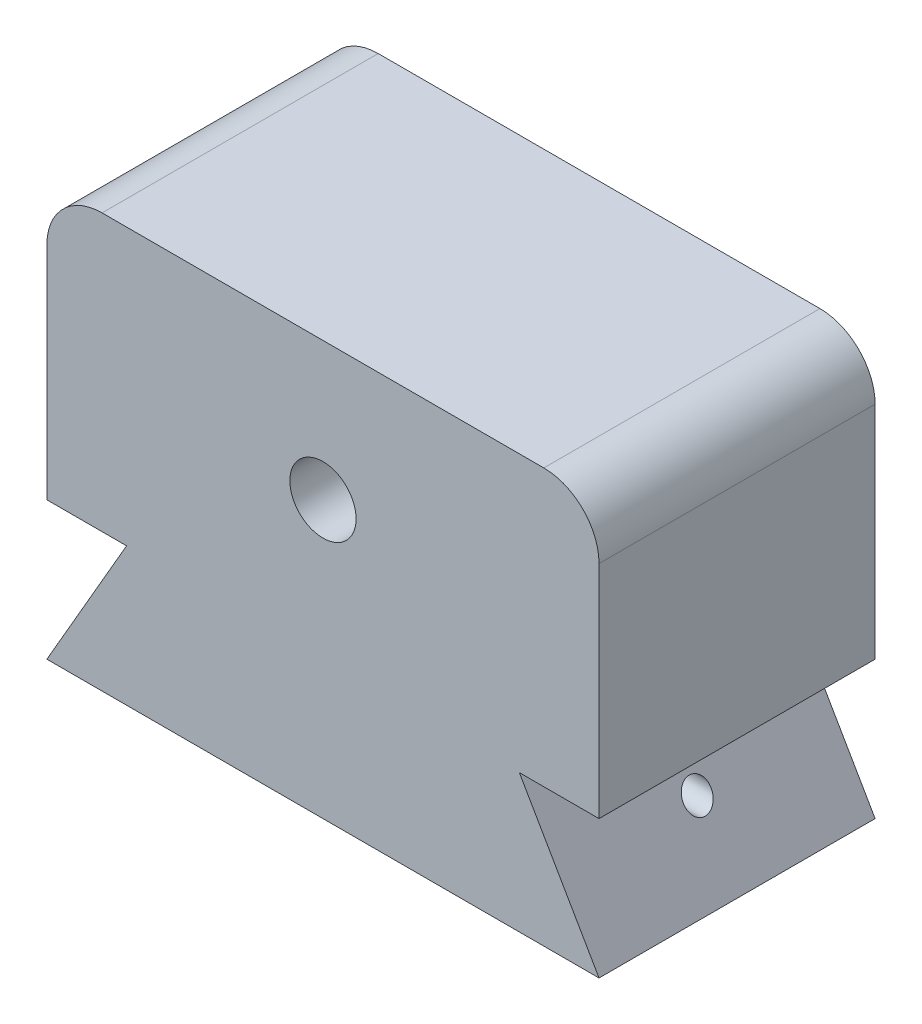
from build123d import *

# Parameters (mm, degrees)
SKETCH1_R                      = 6
BOSS_EXTRUDE1_DEPTH            = 50
SKETCH2_R                      = 6
CUT_EXTRUDE1_DEPTH             = 25
CUT_EXTRUDE2_REACH             = 105.078
SKETCH3_R                      = 2.5
CUT_EXTRUDE2_DIRECTION_2_REACH = 105.078


with BuildPart() as part:
    # Sketch1 → Boss-Extrude1 (new body)
    # profile 1 of 2: a face of its own
    with BuildSketch(Plane.XY):
        Polygon((-50, 0), (50, 0), (35.56624327, 25), (-35.56624327, 25), align=None)
    # profile 2 of 2: a face of its own
    with BuildSketch(Plane.XY):
        with BuildLine():
            Line((-50, 25), (50, 25))
            Line((50, 25), (50, 65))
            ThreePointArc((50, 65), (47.071067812, 72.071067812), (40, 75))
            Line((40, 75), (-40, 75))
            ThreePointArc((-40, 75), (-47.071067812, 72.071067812), (-50, 65))
            Line((-50, 65), (-50, 25))
        make_face()
        with Locations((0, 50)):
            Circle(SKETCH1_R, mode=Mode.SUBTRACT)
    extrude(amount=BOSS_EXTRUDE1_DEPTH)

    # Sketch2 → Cut-Extrude1 (cut)
    with BuildSketch(Plane.XZ):
        with Locations(Location((0, 25, 0), (0, 0, 270))):
            Circle(SKETCH2_R)
    extrude(amount=-CUT_EXTRUDE1_DEPTH, mode=Mode.SUBTRACT)

    # Cut-Extrude2: up to this plane
    cut_extrude2_end = Plane(origin=(-37.5, 21.650635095, 50), z_dir=(0.8660254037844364, -0.5000000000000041, 0))
    # Sketch3 → Cut-Extrude2 (cut, up to the surface)
    with BuildSketch(Plane(origin=(0, 0, 0), x_dir=(0, 0, -1), z_dir=(1, 0, 0)), mode=Mode.PRIVATE) as cut_extrude2_sk1:
        with Locations((-25, 12.5)):
            Circle(SKETCH3_R)
    cut_extrude2_tool1 = split(extrude(cut_extrude2_sk1.sketch, amount=-CUT_EXTRUDE2_REACH, mode=Mode.PRIVATE), bisect_by=cut_extrude2_end, keep=Keep.BOTH, mode=Mode.PRIVATE)
    add(cut_extrude2_tool1.solids().sort_by_distance((0, 12.5, 25))[0], mode=Mode.SUBTRACT)

    # Cut-Extrude2 direction 2: up to this plane
    cut_extrude2_direction_2_end = Plane(origin=(37.5, 21.650635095, 50), z_dir=(-0.8660254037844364, -0.5000000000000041, 0))
    # Sketch3 → Cut-Extrude2 direction 2 (cut, up to the surface)
    with BuildSketch(Plane(origin=(0, 0, 0), x_dir=(0, 0, -1), z_dir=(1, 0, 0)), mode=Mode.PRIVATE) as cut_extrude2_direction_2_sk1:
        with Locations((-25, 12.5)):
            Circle(SKETCH3_R)
    cut_extrude2_direction_2_tool1 = split(extrude(cut_extrude2_direction_2_sk1.sketch, amount=CUT_EXTRUDE2_DIRECTION_2_REACH, mode=Mode.PRIVATE), bisect_by=cut_extrude2_direction_2_end, keep=Keep.BOTH, mode=Mode.PRIVATE)
    add(cut_extrude2_direction_2_tool1.solids().sort_by_distance((0, 12.5, 25))[0], mode=Mode.SUBTRACT)


solid = part.part
